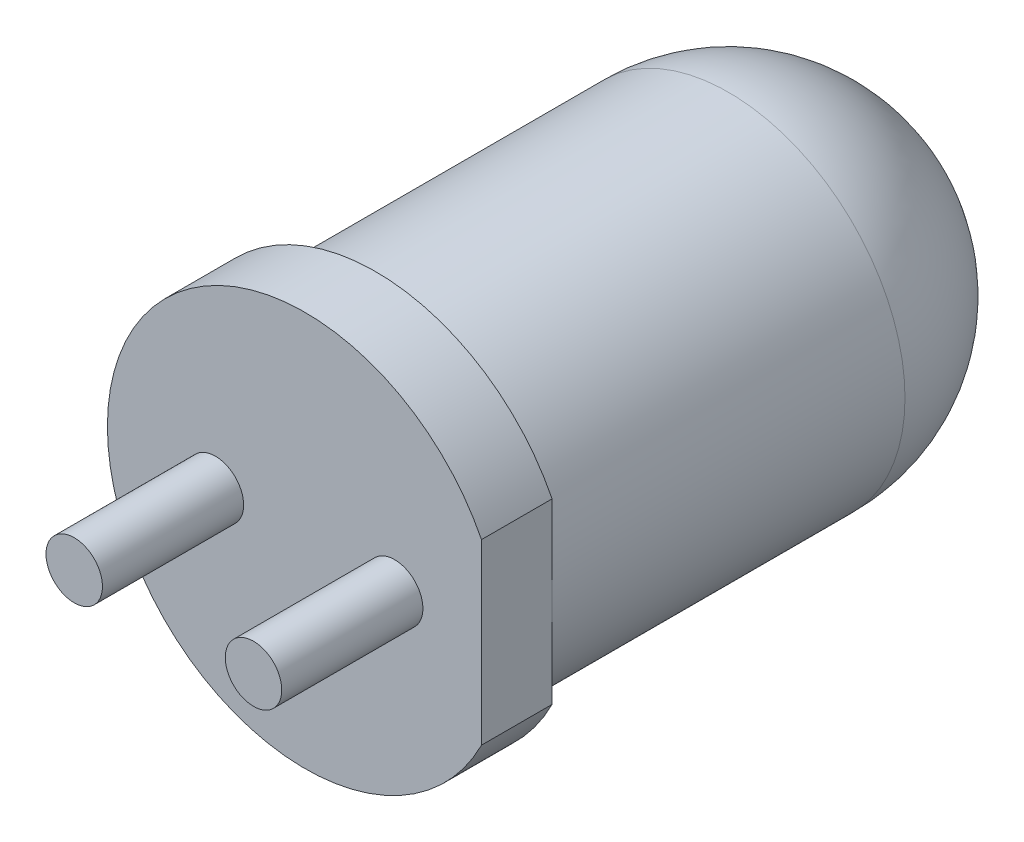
from build123d import *

# Parameters (mm, degrees)
ESQUISSE1_R          = 2.5
BASE_EXTRUSION_DEPTH = 8.5
BOSS_EXTRU_1_DEPTH   = 1
CONG_1_R             = 2.5
ESQUISSE4_R          = 0.4
EXTRUSION1_DEPTH     = 2


with BuildPart() as part:
    # Esquisse1 → Base-Extrusion (new body)
    with BuildSketch(Plane.XY):
        Circle(ESQUISSE1_R)
    extrude(amount=BASE_EXTRUSION_DEPTH)

    # Esquisse2 → Boss.-Extru.1 (add)
    with BuildSketch(Plane.XY.offset(8.5)):
        with BuildLine():
            Line((2.5, 1.260952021), (2.5, -1.260952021))
            ThreePointArc((2.5, -1.260952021), (-2.8, 0), (2.5, 1.260952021))
        make_face()
    extrude(amount=-BOSS_EXTRU_1_DEPTH)

    # Cong_1
    cong_1_edges = [part.edges().sort_by_distance(p)[0] for p in [
        (-2.5, 0, 0),
    ]]
    fillet(cong_1_edges, radius=CONG_1_R)

    # Esquisse4 → Extrusion1 (add)
    with BuildSketch(Plane.XY.offset(8.5)):
        with Locations((1.27, 0)):
            Circle(ESQUISSE4_R)
        with Locations(Location((-1.27, 0, 0), (0, 0, 180))):
            Circle(ESQUISSE4_R)
    extrude(amount=EXTRUSION1_DEPTH)


solid = part.part
